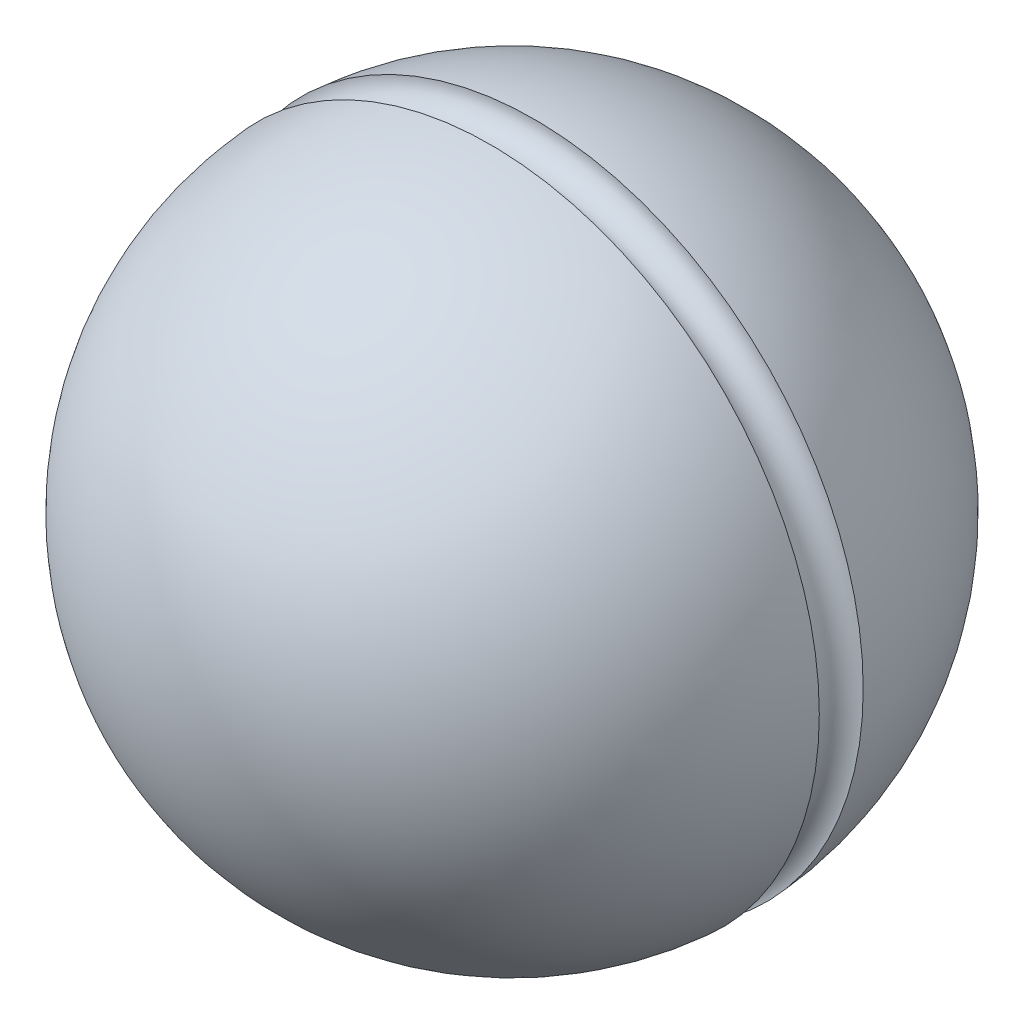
ISO-10303-21;
HEADER;
FILE_DESCRIPTION(('STEP AP214'),'2;1');
FILE_NAME('part.step','',(''),(''),'','','');
FILE_SCHEMA(('AUTOMOTIVE_DESIGN { 1 0 10303 214 1 1 1 1 }'));
ENDSEC;
DATA;
#1=APPLICATION_CONTEXT('core data for automotive mechanical design processes');
#2=APPLICATION_PROTOCOL_DEFINITION('international standard','automotive_design',2000,#1);
#3=PRODUCT_CONTEXT('',#1,'mechanical');
#4=PRODUCT('Part','Part','',(#3));
#5=PRODUCT_RELATED_PRODUCT_CATEGORY('part','',(#4));
#6=PRODUCT_DEFINITION_FORMATION('','',#4);
#7=PRODUCT_DEFINITION_CONTEXT('part definition',#1,'design');
#8=PRODUCT_DEFINITION('design','',#6,#7);
#9=PRODUCT_DEFINITION_SHAPE('','',#8);
#10=(LENGTH_UNIT() NAMED_UNIT(*) SI_UNIT(.MILLI.,.METRE.));
#11=(NAMED_UNIT(*) PLANE_ANGLE_UNIT() SI_UNIT($,.RADIAN.));
#12=(NAMED_UNIT(*) SI_UNIT($,.STERADIAN.) SOLID_ANGLE_UNIT());
#13=UNCERTAINTY_MEASURE_WITH_UNIT(LENGTH_MEASURE(1.E-05),#10,'distance_accuracy_value','');
#14=(GEOMETRIC_REPRESENTATION_CONTEXT(3) GLOBAL_UNCERTAINTY_ASSIGNED_CONTEXT((#13)) GLOBAL_UNIT_ASSIGNED_CONTEXT((#10,
#11,#12)) REPRESENTATION_CONTEXT('',''));
#15=CARTESIAN_POINT('',(0.,0.,0.));
#16=DIRECTION('',(0.,0.,1.));
#17=DIRECTION('',(1.,0.,0.));
#18=AXIS2_PLACEMENT_3D('',#15,#16,#17);
#19=CARTESIAN_POINT('',(0.,0.,12.985949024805));
#20=DIRECTION('',(-1.,0.,0.));
#21=DIRECTION('',(0.,0.,1.));
#22=AXIS2_PLACEMENT_3D('',#19,#20,#21);
#23=SPHERICAL_SURFACE('',#22,14.9961619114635);
#24=CARTESIAN_POINT('',(0.,0.,12.985949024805));
#25=DIRECTION('',(0.,0.,1.));
#26=DIRECTION('',(1.,0.,0.));
#27=AXIS2_PLACEMENT_3D('',#24,#25,#26);
#28=SPHERICAL_SURFACE('',#27,14.9961619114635);
#29=CARTESIAN_POINT('',(0.,0.,0.));
#30=DIRECTION('',(0.,0.,1.));
#31=DIRECTION('',(1.,0.,0.));
#32=AXIS2_PLACEMENT_3D('',#29,#30,#31);
#33=CIRCLE('',#32,7.5);
#34=CARTESIAN_POINT('',(7.5,0.,0.));
#35=VERTEX_POINT('',#34);
#36=EDGE_CURVE('E8',#35,#35,#33,.T.);
#37=ORIENTED_EDGE('',*,*,#36,.T.);
#38=EDGE_LOOP('',(#37));
#39=FACE_BOUND('',#38,.T.);
#40=CARTESIAN_POINT('',(0.,0.,11.969554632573));
#41=DIRECTION('',(0.,0.,1.));
#42=DIRECTION('',(1.,0.,0.));
#43=AXIS2_PLACEMENT_3D('',#40,#41,#42);
#44=CIRCLE('',#43,14.9616781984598);
#45=CARTESIAN_POINT('',(14.9616781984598,0.,11.969554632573));
#46=VERTEX_POINT('',#45);
#47=EDGE_CURVE('E31',#46,#46,#44,.T.);
#48=ORIENTED_EDGE('',*,*,#47,.F.);
#49=EDGE_LOOP('',(#48));
#50=FACE_BOUND('',#49,.T.);
#51=ADVANCED_FACE('F12',(#39,#50),#28,.T.);
#52=CARTESIAN_POINT('',(0.,4.,0.));
#53=DIRECTION('',(0.,0.,1.));
#54=DIRECTION('',(1.,0.,0.));
#55=AXIS2_PLACEMENT_3D('',#52,#53,#54);
#56=PLANE('',#55);
#57=ORIENTED_EDGE('',*,*,#36,.F.);
#58=EDGE_LOOP('',(#57));
#59=FACE_BOUND('',#58,.T.);
#60=CARTESIAN_POINT('',(0.,0.,0.));
#61=DIRECTION('',(0.,0.,1.));
#62=DIRECTION('',(1.,0.,0.));
#63=AXIS2_PLACEMENT_3D('',#60,#61,#62);
#64=CIRCLE('',#63,4.);
#65=CARTESIAN_POINT('',(4.,0.,0.));
#66=VERTEX_POINT('',#65);
#67=EDGE_CURVE('E18',#66,#66,#64,.T.);
#68=ORIENTED_EDGE('',*,*,#67,.T.);
#69=EDGE_LOOP('',(#68));
#70=FACE_BOUND('',#69,.T.);
#71=ADVANCED_FACE('F38',(#59,#70),#56,.F.);
#72=CARTESIAN_POINT('',(0.,0.,32.985949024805));
#73=DIRECTION('',(0.,0.,1.));
#74=DIRECTION('',(1.,0.,0.));
#75=AXIS2_PLACEMENT_3D('',#72,#73,#74);
#76=CYLINDRICAL_SURFACE('',#75,4.);
#77=CARTESIAN_POINT('',(0.,0.,14.));
#78=DIRECTION('',(0.,0.,1.));
#79=DIRECTION('',(1.,0.,0.));
#80=AXIS2_PLACEMENT_3D('',#77,#78,#79);
#81=CIRCLE('',#80,4.);
#82=CARTESIAN_POINT('',(4.,0.,14.));
#83=VERTEX_POINT('',#82);
#84=EDGE_CURVE('E22',#83,#83,#81,.T.);
#85=ORIENTED_EDGE('',*,*,#84,.T.);
#86=EDGE_LOOP('',(#85));
#87=FACE_BOUND('',#86,.T.);
#88=ORIENTED_EDGE('',*,*,#67,.F.);
#89=EDGE_LOOP('',(#88));
#90=FACE_BOUND('',#89,.T.);
#91=ADVANCED_FACE('F43',(#87,#90),#76,.F.);
#92=CARTESIAN_POINT('',(0.,4.,14.));
#93=DIRECTION('',(0.,0.,-1.));
#94=DIRECTION('',(-1.,0.,0.));
#95=AXIS2_PLACEMENT_3D('',#92,#93,#94);
#96=PLANE('',#95);
#97=ORIENTED_EDGE('',*,*,#84,.F.);
#98=EDGE_LOOP('',(#97));
#99=FACE_BOUND('',#98,.T.);
#100=ADVANCED_FACE('F48',(#99),#96,.T.);
#101=CARTESIAN_POINT('',(0.,0.,12.985949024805));
#102=DIRECTION('',(-1.,0.,0.));
#103=DIRECTION('',(0.,0.,1.));
#104=AXIS2_PLACEMENT_3D('',#101,#102,#103);
#105=SPHERICAL_SURFACE('',#104,14.9961619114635);
#106=CARTESIAN_POINT('',(0.,0.,12.985949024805));
#107=DIRECTION('',(0.,0.,1.));
#108=DIRECTION('',(1.,0.,0.));
#109=AXIS2_PLACEMENT_3D('',#106,#107,#108);
#110=SPHERICAL_SURFACE('',#109,14.9961619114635);
#111=CARTESIAN_POINT('',(0.,0.,13.969348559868));
#112=DIRECTION('',(0.,0.,1.));
#113=DIRECTION('',(1.,0.,0.));
#114=AXIS2_PLACEMENT_3D('',#111,#112,#113);
#115=CIRCLE('',#114,14.9638830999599);
#116=CARTESIAN_POINT('',(14.9638830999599,0.,13.969348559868));
#117=VERTEX_POINT('',#116);
#118=EDGE_CURVE('E26',#117,#117,#115,.T.);
#119=ORIENTED_EDGE('',*,*,#118,.T.);
#120=EDGE_LOOP('',(#119));
#121=FACE_BOUND('',#120,.T.);
#122=ADVANCED_FACE('F54',(#121),#110,.T.);
#123=CARTESIAN_POINT('',(0.,0.,12.9694673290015));
#124=DIRECTION('',(0.,0.,1.));
#125=DIRECTION('',(1.,0.,0.));
#126=AXIS2_PLACEMENT_3D('',#123,#124,#125);
#127=TOROIDAL_SURFACE('',#126,14.9485113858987,0.99999938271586);
#128=ORIENTED_EDGE('',*,*,#118,.F.);
#129=EDGE_LOOP('',(#128));
#130=FACE_BOUND('',#129,.T.);
#131=ORIENTED_EDGE('',*,*,#47,.T.);
#132=EDGE_LOOP('',(#131));
#133=FACE_BOUND('',#132,.T.);
#134=ADVANCED_FACE('F35',(#130,#133),#127,.F.);
#135=CLOSED_SHELL('',(#51,#71,#91,#100,#122,#134));
#136=MANIFOLD_SOLID_BREP('B1',#135);
#137=ADVANCED_BREP_SHAPE_REPRESENTATION('',(#18,#136),#14);
#138=SHAPE_DEFINITION_REPRESENTATION(#9,#137);
ENDSEC;
END-ISO-10303-21;
